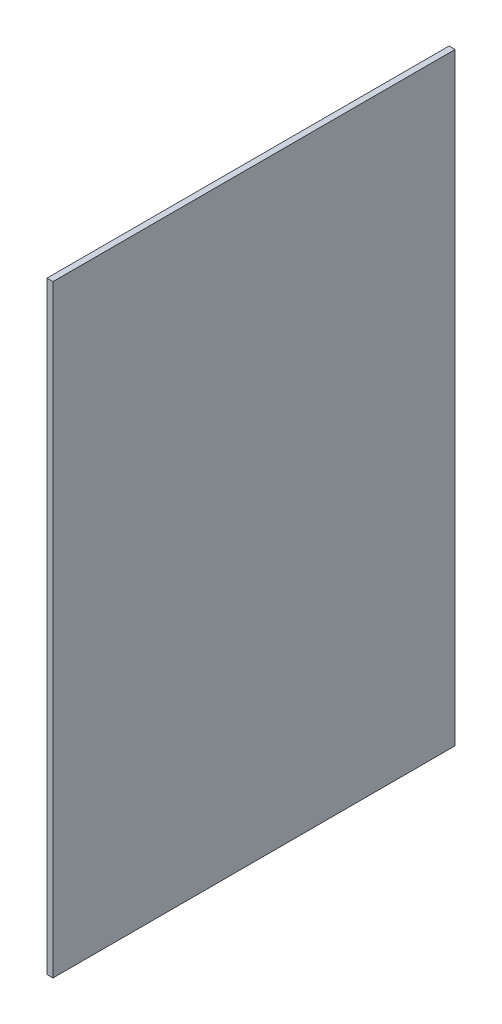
from build123d import *

# Parameters (mm, degrees)
SKIZZE1_W               = 200
SKIZZE1_H               = 300
LINEAR_AUSTRAGEN1_DEPTH = 3


with BuildPart() as part:
    # Skizze1 → Linear austragen1 (new body)
    with BuildSketch(Plane(origin=(0, 0, 0), x_dir=(0, 0, -1), z_dir=(1, 0, 0))):
        Rectangle(SKIZZE1_W, SKIZZE1_H)
    extrude(amount=LINEAR_AUSTRAGEN1_DEPTH)


solid = part.part
